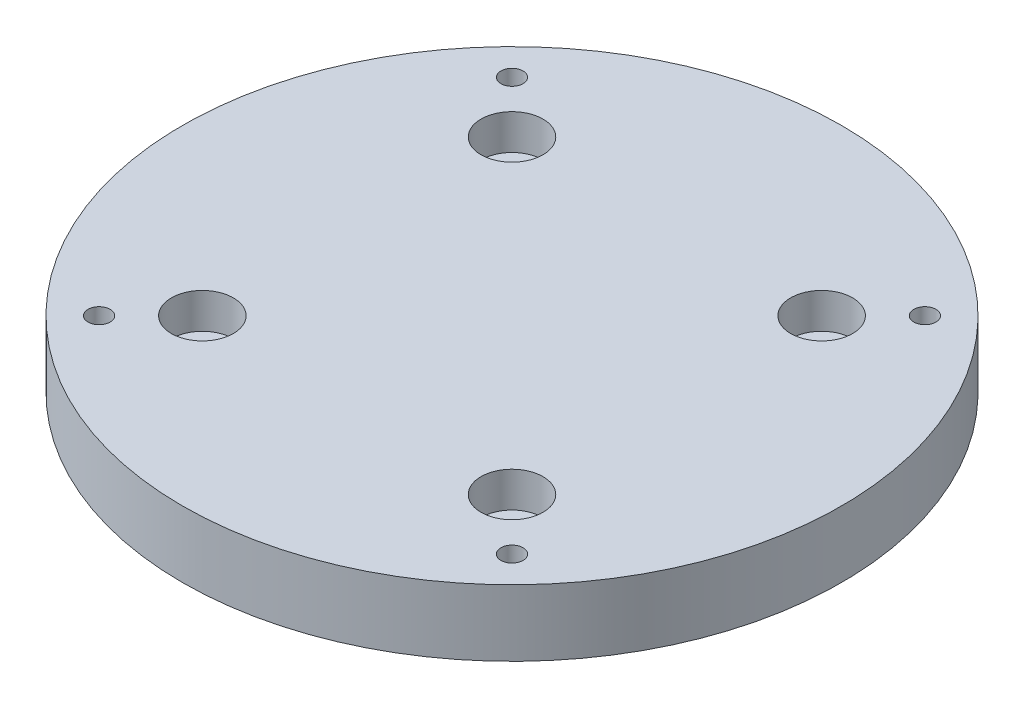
from build123d import *

# Parameters (mm, degrees)
ESQUISSE1_R             = 74.5
BOSS_EXTRU_1_DEPTH      = 15
TROU_TARAUD_M6X1_01_D   = 5
ESQUISSE4_R             = 4.05
ENL_V_MAT_EXTRU_1_DEPTH = 107.421332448
ESQUISSE5_R             = 7
ENL_V_MAT_EXTRU_2_DEPTH = 8


with BuildPart() as part:
    # Esquisse1 → Boss.-Extru.1 (new body)
    with BuildSketch(Plane(origin=(0, 0, 0), x_dir=(1, 0, 0), z_dir=(0, 1, 0))):
        with Locations(Location((0, 0, 0), (0, 0, 270))):
            Circle(ESQUISSE1_R)
    extrude(amount=BOSS_EXTRU_1_DEPTH)

    # Trou taraud_ M6x1.01 (through all)
    with Locations(Plane(origin=(0, 15, 0), x_dir=(1, 0, 0), z_dir=(0, 1, 0))):
        with Locations((46.669047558, 46.669047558), (-46.669047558, 46.669047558), (-46.669047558, -46.669047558), (46.669047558, -46.669047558)):
            Hole(TROU_TARAUD_M6X1_01_D / 2)

    # Esquisse4 → Enl_v. mat.-Extru.1 (cut, through all)
    with BuildSketch(Plane(origin=(0, 15, 0), x_dir=(1, 0, 0), z_dir=(0, 1, 0))):
        with Locations(Location((-35, 35, 0), (0, 0, 270))):
            Circle(ESQUISSE4_R)
        with Locations(Location((35, 35, 0), (0, 0, 270))):
            Circle(ESQUISSE4_R)
        with Locations(Location((35, -35, 0), (0, 0, 270))):
            Circle(ESQUISSE4_R)
        with Locations(Location((-35, -35, 0), (0, 0, 270))):
            Circle(ESQUISSE4_R)
    extrude(amount=-ENL_V_MAT_EXTRU_1_DEPTH, mode=Mode.SUBTRACT)

    # Esquisse5 → Enl_v. mat.-Extru.2 (cut)
    with BuildSketch(Plane(origin=(0, 15, 0), x_dir=(1, 0, 0), z_dir=(0, 1, 0))):
        with Locations(Location((-35, 35, 0), (0, 0, 270))):
            Circle(ESQUISSE5_R)
        with Locations(Location((35, 35, 0), (0, 0, 270))):
            Circle(ESQUISSE5_R)
        with Locations(Location((35, -35, 0), (0, 0, 270))):
            Circle(ESQUISSE5_R)
        with Locations(Location((-35, -35, 0), (0, 0, 270))):
            Circle(ESQUISSE5_R)
    extrude(amount=-ENL_V_MAT_EXTRU_2_DEPTH, mode=Mode.SUBTRACT)


solid = part.part
